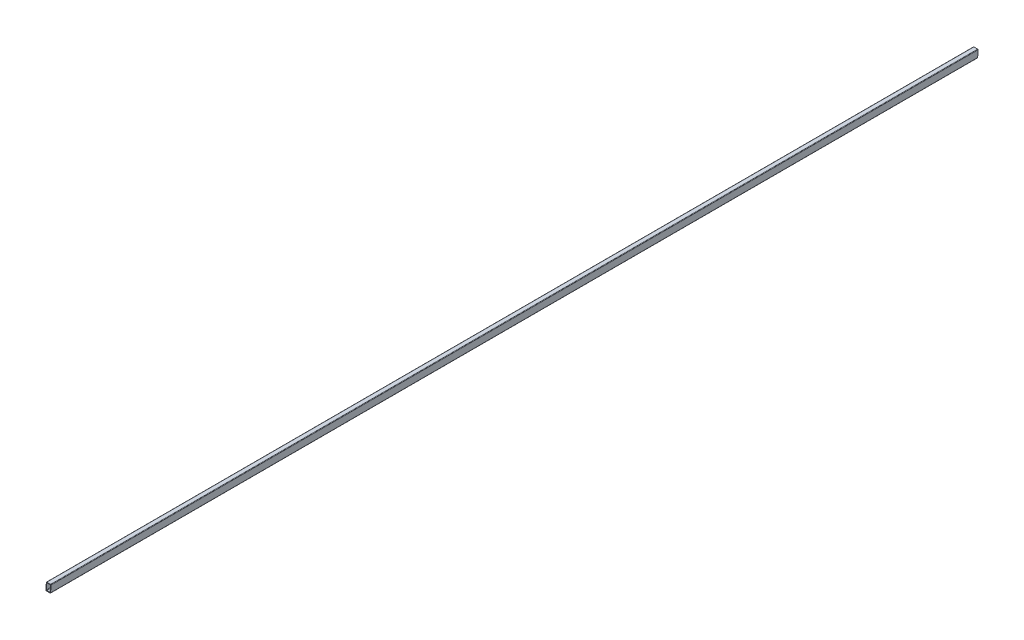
ISO-10303-21;
HEADER;
FILE_DESCRIPTION(('STEP AP214'),'2;1');
FILE_NAME('part.step','',(''),(''),'','','');
FILE_SCHEMA(('AUTOMOTIVE_DESIGN { 1 0 10303 214 1 1 1 1 }'));
ENDSEC;
DATA;
#1=APPLICATION_CONTEXT('core data for automotive mechanical design processes');
#2=APPLICATION_PROTOCOL_DEFINITION('international standard','automotive_design',2000,#1);
#3=PRODUCT_CONTEXT('',#1,'mechanical');
#4=PRODUCT('Part','Part','',(#3));
#5=PRODUCT_RELATED_PRODUCT_CATEGORY('part','',(#4));
#6=PRODUCT_DEFINITION_FORMATION('','',#4);
#7=PRODUCT_DEFINITION_CONTEXT('part definition',#1,'design');
#8=PRODUCT_DEFINITION('design','',#6,#7);
#9=PRODUCT_DEFINITION_SHAPE('','',#8);
#10=(LENGTH_UNIT() NAMED_UNIT(*) SI_UNIT(.MILLI.,.METRE.));
#11=(NAMED_UNIT(*) PLANE_ANGLE_UNIT() SI_UNIT($,.RADIAN.));
#12=(NAMED_UNIT(*) SI_UNIT($,.STERADIAN.) SOLID_ANGLE_UNIT());
#13=UNCERTAINTY_MEASURE_WITH_UNIT(LENGTH_MEASURE(1.E-05),#10,'distance_accuracy_value','');
#14=(GEOMETRIC_REPRESENTATION_CONTEXT(3) GLOBAL_UNCERTAINTY_ASSIGNED_CONTEXT((#13)) GLOBAL_UNIT_ASSIGNED_CONTEXT((#10,
#11,#12)) REPRESENTATION_CONTEXT('',''));
#15=CARTESIAN_POINT('',(0.,0.,0.));
#16=DIRECTION('',(0.,0.,1.));
#17=DIRECTION('',(1.,0.,0.));
#18=AXIS2_PLACEMENT_3D('',#15,#16,#17);
#19=CARTESIAN_POINT('',(-25.,40.,10200.));
#20=DIRECTION('',(1.,0.,0.));
#21=DIRECTION('',(0.,1.,0.));
#22=AXIS2_PLACEMENT_3D('',#19,#20,#21);
#23=PLANE('',#22);
#24=DIRECTION('',(0.,0.,-1.));
#25=VECTOR('',#24,1.);
#26=CARTESIAN_POINT('',(-25.,-35.,10200.));
#27=LINE('',#26,#25);
#28=CARTESIAN_POINT('',(-25.,-35.,3.74999314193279));
#29=VERTEX_POINT('',#28);
#30=CARTESIAN_POINT('',(-25.,-35.,10016.2399931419));
#31=VERTEX_POINT('',#30);
#32=EDGE_CURVE('E189',#29,#31,#27,.F.);
#33=ORIENTED_EDGE('',*,*,#32,.T.);
#34=DIRECTION('',(0.,0.998752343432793,-0.049937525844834));
#35=VECTOR('',#34,1.);
#36=CARTESIAN_POINT('',(-25.,40.,10012.49));
#37=LINE('',#36,#35);
#38=CARTESIAN_POINT('',(-25.,35.,10012.7399995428));
#39=VERTEX_POINT('',#38);
#40=EDGE_CURVE('E166',#31,#39,#37,.T.);
#41=ORIENTED_EDGE('',*,*,#40,.T.);
#42=DIRECTION('',(0.,0.,-1.));
#43=VECTOR('',#42,1.);
#44=CARTESIAN_POINT('',(-25.,35.,10200.));
#45=LINE('',#44,#43);
#46=CARTESIAN_POINT('',(-25.,35.,0.249999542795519));
#47=VERTEX_POINT('',#46);
#48=EDGE_CURVE('E187',#39,#47,#45,.T.);
#49=ORIENTED_EDGE('',*,*,#48,.T.);
#50=DIRECTION('',(0.,-0.998752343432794,0.0499375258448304));
#51=VECTOR('',#50,1.);
#52=CARTESIAN_POINT('',(-25.,40.,0.));
#53=LINE('',#52,#51);
#54=EDGE_CURVE('E223',#47,#29,#53,.T.);
#55=ORIENTED_EDGE('',*,*,#54,.T.);
#56=EDGE_LOOP('',(#33,#41,#49,#55));
#57=FACE_BOUND('',#56,.T.);
#58=ADVANCED_FACE('F38',(#57),#23,.F.);
#59=CARTESIAN_POINT('',(-25.,-40.,10200.));
#60=DIRECTION('',(0.,1.,0.));
#61=DIRECTION('',(0.,0.,1.));
#62=AXIS2_PLACEMENT_3D('',#59,#60,#61);
#63=PLANE('',#62);
#64=DIRECTION('',(0.,0.,-1.));
#65=VECTOR('',#64,1.);
#66=CARTESIAN_POINT('',(20.,-40.,10200.));
#67=LINE('',#66,#65);
#68=CARTESIAN_POINT('',(20.,-40.,3.99999268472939));
#69=VERTEX_POINT('',#68);
#70=CARTESIAN_POINT('',(20.,-40.,10016.4899926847));
#71=VERTEX_POINT('',#70);
#72=EDGE_CURVE('E185',#69,#71,#67,.F.);
#73=ORIENTED_EDGE('',*,*,#72,.T.);
#74=DIRECTION('',(-1.,0.,0.));
#75=VECTOR('',#74,1.);
#76=CARTESIAN_POINT('',(-25.,-40.,10016.4899926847));
#77=LINE('',#76,#75);
#78=CARTESIAN_POINT('',(-20.,-40.,10016.4899926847));
#79=VERTEX_POINT('',#78);
#80=EDGE_CURVE('E151',#71,#79,#77,.T.);
#81=ORIENTED_EDGE('',*,*,#80,.T.);
#82=DIRECTION('',(0.,0.,-1.));
#83=VECTOR('',#82,1.);
#84=CARTESIAN_POINT('',(-20.,-40.,10200.));
#85=LINE('',#84,#83);
#86=CARTESIAN_POINT('',(-20.,-40.,3.99999268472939));
#87=VERTEX_POINT('',#86);
#88=EDGE_CURVE('E183',#79,#87,#85,.T.);
#89=ORIENTED_EDGE('',*,*,#88,.T.);
#90=DIRECTION('',(1.,0.,0.));
#91=VECTOR('',#90,1.);
#92=CARTESIAN_POINT('',(-24.9999999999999,-40.,3.99999268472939));
#93=LINE('',#92,#91);
#94=EDGE_CURVE('E270',#87,#69,#93,.T.);
#95=ORIENTED_EDGE('',*,*,#94,.T.);
#96=EDGE_LOOP('',(#73,#81,#89,#95));
#97=FACE_BOUND('',#96,.T.);
#98=ADVANCED_FACE('F306',(#97),#63,.F.);
#99=CARTESIAN_POINT('',(25.,40.,10200.));
#100=DIRECTION('',(-1.,0.,0.));
#101=DIRECTION('',(0.,-1.,0.));
#102=AXIS2_PLACEMENT_3D('',#99,#100,#101);
#103=PLANE('',#102);
#104=DIRECTION('',(0.,0.,-1.));
#105=VECTOR('',#104,1.);
#106=CARTESIAN_POINT('',(25.,35.,10200.));
#107=LINE('',#106,#105);
#108=CARTESIAN_POINT('',(25.,35.,0.24999954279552));
#109=VERTEX_POINT('',#108);
#110=CARTESIAN_POINT('',(25.,35.,10012.7399995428));
#111=VERTEX_POINT('',#110);
#112=EDGE_CURVE('E165',#109,#111,#107,.F.);
#113=ORIENTED_EDGE('',*,*,#112,.T.);
#114=DIRECTION('',(0.,0.998752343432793,-0.049937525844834));
#115=VECTOR('',#114,1.);
#116=CARTESIAN_POINT('',(25.,40.,10012.49));
#117=LINE('',#116,#115);
#118=CARTESIAN_POINT('',(25.,-35.,10016.2399931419));
#119=VERTEX_POINT('',#118);
#120=EDGE_CURVE('E60',#119,#111,#117,.T.);
#121=ORIENTED_EDGE('',*,*,#120,.F.);
#122=DIRECTION('',(0.,0.,-1.));
#123=VECTOR('',#122,1.);
#124=CARTESIAN_POINT('',(25.,-35.,10200.));
#125=LINE('',#124,#123);
#126=CARTESIAN_POINT('',(25.,-35.,3.7499931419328));
#127=VERTEX_POINT('',#126);
#128=EDGE_CURVE('E162',#119,#127,#125,.T.);
#129=ORIENTED_EDGE('',*,*,#128,.T.);
#130=DIRECTION('',(0.,-0.998752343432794,0.0499375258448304));
#131=VECTOR('',#130,1.);
#132=CARTESIAN_POINT('',(25.,40.,0.));
#133=LINE('',#132,#131);
#134=EDGE_CURVE('E262',#109,#127,#133,.T.);
#135=ORIENTED_EDGE('',*,*,#134,.F.);
#136=EDGE_LOOP('',(#113,#121,#129,#135));
#137=FACE_BOUND('',#136,.T.);
#138=ADVANCED_FACE('F160',(#137),#103,.F.);
#139=CARTESIAN_POINT('',(-25.,40.,10200.));
#140=DIRECTION('',(0.,-1.,0.));
#141=DIRECTION('',(1.,0.,0.));
#142=AXIS2_PLACEMENT_3D('',#139,#140,#141);
#143=PLANE('',#142);
#144=DIRECTION('',(0.,0.,-1.));
#145=VECTOR('',#144,1.);
#146=CARTESIAN_POINT('',(-20.,40.,10200.));
#147=LINE('',#146,#145);
#148=CARTESIAN_POINT('',(-20.,40.,0.));
#149=VERTEX_POINT('',#148);
#150=CARTESIAN_POINT('',(-20.,40.,10012.49));
#151=VERTEX_POINT('',#150);
#152=EDGE_CURVE('E194',#149,#151,#147,.F.);
#153=ORIENTED_EDGE('',*,*,#152,.T.);
#154=DIRECTION('',(1.,0.,0.));
#155=VECTOR('',#154,1.);
#156=CARTESIAN_POINT('',(-25.,40.,10012.49));
#157=LINE('',#156,#155);
#158=CARTESIAN_POINT('',(20.,40.,10012.49));
#159=VERTEX_POINT('',#158);
#160=EDGE_CURVE('E431',#151,#159,#157,.T.);
#161=ORIENTED_EDGE('',*,*,#160,.T.);
#162=DIRECTION('',(0.,0.,-1.));
#163=VECTOR('',#162,1.);
#164=CARTESIAN_POINT('',(20.,40.,10200.));
#165=LINE('',#164,#163);
#166=CARTESIAN_POINT('',(20.,40.,0.));
#167=VERTEX_POINT('',#166);
#168=EDGE_CURVE('E192',#159,#167,#165,.T.);
#169=ORIENTED_EDGE('',*,*,#168,.T.);
#170=DIRECTION('',(-1.,0.,0.));
#171=VECTOR('',#170,1.);
#172=CARTESIAN_POINT('',(-25.,40.,0.));
#173=LINE('',#172,#171);
#174=EDGE_CURVE('E273',#167,#149,#173,.T.);
#175=ORIENTED_EDGE('',*,*,#174,.T.);
#176=EDGE_LOOP('',(#153,#161,#169,#175));
#177=FACE_BOUND('',#176,.T.);
#178=ADVANCED_FACE('F333',(#177),#143,.F.);
#179=CARTESIAN_POINT('',(-20.,35.,10200.));
#180=DIRECTION('',(1.,0.,0.));
#181=DIRECTION('',(0.,1.,0.));
#182=AXIS2_PLACEMENT_3D('',#179,#180,#181);
#183=PLANE('',#182);
#184=DIRECTION('',(0.,0.998752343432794,-0.0499375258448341));
#185=VECTOR('',#184,1.);
#186=CARTESIAN_POINT('',(-20.,25.6603660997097,10013.2069803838));
#187=LINE('',#186,#185);
#188=CARTESIAN_POINT('',(-20.,-30.,10015.9899935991));
#189=VERTEX_POINT('',#188);
#190=CARTESIAN_POINT('',(-20.,30.0000000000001,10012.9899990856));
#191=VERTEX_POINT('',#190);
#192=EDGE_CURVE('E257',#189,#191,#187,.T.);
#193=ORIENTED_EDGE('',*,*,#192,.F.);
#194=DIRECTION('',(0.,0.,-1.));
#195=VECTOR('',#194,1.);
#196=CARTESIAN_POINT('',(-20.,-30.,3.74999314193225));
#197=LINE('',#196,#195);
#198=CARTESIAN_POINT('',(-20.,-30.,3.49999359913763));
#199=VERTEX_POINT('',#198);
#200=EDGE_CURVE('E280',#189,#199,#197,.T.);
#201=ORIENTED_EDGE('',*,*,#200,.T.);
#202=DIRECTION('',(0.,-0.998752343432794,0.0499375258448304));
#203=VECTOR('',#202,1.);
#204=CARTESIAN_POINT('',(-20.,-473.714785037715,25.6856922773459));
#205=LINE('',#204,#203);
#206=CARTESIAN_POINT('',(-20.,30.0000000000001,0.499999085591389));
#207=VERTEX_POINT('',#206);
#208=EDGE_CURVE('E267',#207,#199,#205,.T.);
#209=ORIENTED_EDGE('',*,*,#208,.F.);
#210=DIRECTION('',(0.,0.,-1.));
#211=VECTOR('',#210,1.);
#212=CARTESIAN_POINT('',(-20.,30.,10200.));
#213=LINE('',#212,#211);
#214=EDGE_CURVE('E277',#207,#191,#213,.F.);
#215=ORIENTED_EDGE('',*,*,#214,.T.);
#216=EDGE_LOOP('',(#193,#201,#209,#215));
#217=FACE_BOUND('',#216,.T.);
#218=ADVANCED_FACE('F292',(#217),#183,.T.);
#219=CARTESIAN_POINT('',(-20.,-35.,10200.));
#220=DIRECTION('',(0.,1.,0.));
#221=DIRECTION('',(0.,0.,1.));
#222=AXIS2_PLACEMENT_3D('',#219,#220,#221);
#223=PLANE('',#222);
#224=DIRECTION('',(-1.,0.,0.));
#225=VECTOR('',#224,1.);
#226=CARTESIAN_POINT('',(-20.,-35.,10016.2399931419));
#227=LINE('',#226,#225);
#228=CARTESIAN_POINT('',(15.,-35.,10016.2399931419));
#229=VERTEX_POINT('',#228);
#230=CARTESIAN_POINT('',(-15.,-35.,10016.2399931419));
#231=VERTEX_POINT('',#230);
#232=EDGE_CURVE('E249',#229,#231,#227,.T.);
#233=ORIENTED_EDGE('',*,*,#232,.F.);
#234=DIRECTION('',(0.,0.,-1.));
#235=VECTOR('',#234,1.);
#236=CARTESIAN_POINT('',(15.,-35.,3.74999314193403));
#237=LINE('',#236,#235);
#238=CARTESIAN_POINT('',(15.,-35.,3.74999314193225));
#239=VERTEX_POINT('',#238);
#240=EDGE_CURVE('E231',#229,#239,#237,.T.);
#241=ORIENTED_EDGE('',*,*,#240,.T.);
#242=DIRECTION('',(1.,0.,0.));
#243=VECTOR('',#242,1.);
#244=CARTESIAN_POINT('',(-19.9999999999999,-35.,3.74999314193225));
#245=LINE('',#244,#243);
#246=CARTESIAN_POINT('',(-15.,-35.,3.74999314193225));
#247=VERTEX_POINT('',#246);
#248=EDGE_CURVE('E212',#247,#239,#245,.T.);
#249=ORIENTED_EDGE('',*,*,#248,.F.);
#250=DIRECTION('',(0.,0.,-1.));
#251=VECTOR('',#250,1.);
#252=CARTESIAN_POINT('',(-15.,-35.,10200.));
#253=LINE('',#252,#251);
#254=EDGE_CURVE('E226',#247,#231,#253,.F.);
#255=ORIENTED_EDGE('',*,*,#254,.T.);
#256=EDGE_LOOP('',(#233,#241,#249,#255));
#257=FACE_BOUND('',#256,.T.);
#258=ADVANCED_FACE('F283',(#257),#223,.T.);
#259=CARTESIAN_POINT('',(20.,35.,10200.));
#260=DIRECTION('',(-1.,0.,0.));
#261=DIRECTION('',(0.,-1.,0.));
#262=AXIS2_PLACEMENT_3D('',#259,#260,#261);
#263=PLANE('',#262);
#264=DIRECTION('',(0.,-0.998752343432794,0.0499375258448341));
#265=VECTOR('',#264,1.);
#266=CARTESIAN_POINT('',(20.,25.6603660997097,10013.2069803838));
#267=LINE('',#266,#265);
#268=CARTESIAN_POINT('',(20.,30.0000000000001,10012.9899990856));
#269=VERTEX_POINT('',#268);
#270=CARTESIAN_POINT('',(20.,-30.,10015.9899935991));
#271=VERTEX_POINT('',#270);
#272=EDGE_CURVE('E53',#269,#271,#267,.T.);
#273=ORIENTED_EDGE('',*,*,#272,.F.);
#274=DIRECTION('',(0.,0.,-1.));
#275=VECTOR('',#274,1.);
#276=CARTESIAN_POINT('',(20.,30.,0.249999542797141));
#277=LINE('',#276,#275);
#278=CARTESIAN_POINT('',(20.,30.0000000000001,0.499999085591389));
#279=VERTEX_POINT('',#278);
#280=EDGE_CURVE('E221',#269,#279,#277,.T.);
#281=ORIENTED_EDGE('',*,*,#280,.T.);
#282=DIRECTION('',(0.,0.998752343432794,-0.0499375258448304));
#283=VECTOR('',#282,1.);
#284=CARTESIAN_POINT('',(20.0000000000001,-473.714785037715,25.6856922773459));
#285=LINE('',#284,#283);
#286=CARTESIAN_POINT('',(20.,-30.,3.49999359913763));
#287=VERTEX_POINT('',#286);
#288=EDGE_CURVE('E210',#287,#279,#285,.T.);
#289=ORIENTED_EDGE('',*,*,#288,.F.);
#290=DIRECTION('',(0.,0.,-1.));
#291=VECTOR('',#290,1.);
#292=CARTESIAN_POINT('',(20.,-30.,10200.));
#293=LINE('',#292,#291);
#294=EDGE_CURVE('E219',#287,#271,#293,.F.);
#295=ORIENTED_EDGE('',*,*,#294,.T.);
#296=EDGE_LOOP('',(#273,#281,#289,#295));
#297=FACE_BOUND('',#296,.T.);
#298=ADVANCED_FACE('F218',(#297),#263,.T.);
#299=CARTESIAN_POINT('',(-20.,35.,10200.));
#300=DIRECTION('',(0.,-1.,0.));
#301=DIRECTION('',(0.,0.,-1.));
#302=AXIS2_PLACEMENT_3D('',#299,#300,#301);
#303=PLANE('',#302);
#304=DIRECTION('',(1.,0.,0.));
#305=VECTOR('',#304,1.);
#306=CARTESIAN_POINT('',(-20.,35.,10012.7399995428));
#307=LINE('',#306,#305);
#308=CARTESIAN_POINT('',(-15.,35.,10012.7399995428));
#309=VERTEX_POINT('',#308);
#310=CARTESIAN_POINT('',(15.,35.,10012.7399995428));
#311=VERTEX_POINT('',#310);
#312=EDGE_CURVE('E241',#309,#311,#307,.T.);
#313=ORIENTED_EDGE('',*,*,#312,.F.);
#314=DIRECTION('',(0.,0.,-1.));
#315=VECTOR('',#314,1.);
#316=CARTESIAN_POINT('',(-15.,35.,0.249999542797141));
#317=LINE('',#316,#315);
#318=CARTESIAN_POINT('',(-15.,35.,0.249999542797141));
#319=VERTEX_POINT('',#318);
#320=EDGE_CURVE('E228',#309,#319,#317,.T.);
#321=ORIENTED_EDGE('',*,*,#320,.T.);
#322=DIRECTION('',(-1.,0.,0.));
#323=VECTOR('',#322,1.);
#324=CARTESIAN_POINT('',(-19.9999999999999,35.,0.249999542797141));
#325=LINE('',#324,#323);
#326=CARTESIAN_POINT('',(15.,35.,0.249999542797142));
#327=VERTEX_POINT('',#326);
#328=EDGE_CURVE('E243',#327,#319,#325,.T.);
#329=ORIENTED_EDGE('',*,*,#328,.F.);
#330=DIRECTION('',(0.,0.,-1.));
#331=VECTOR('',#330,1.);
#332=CARTESIAN_POINT('',(15.,35.,10200.));
#333=LINE('',#332,#331);
#334=EDGE_CURVE('E175',#327,#311,#333,.F.);
#335=ORIENTED_EDGE('',*,*,#334,.T.);
#336=EDGE_LOOP('',(#313,#321,#329,#335));
#337=FACE_BOUND('',#336,.T.);
#338=ADVANCED_FACE('F240',(#337),#303,.T.);
#339=CARTESIAN_POINT('',(-25.,40.,0.));
#340=DIRECTION('',(0.,0.0499375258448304,0.998752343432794));
#341=DIRECTION('',(0.,-0.998752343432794,0.0499375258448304));
#342=AXIS2_PLACEMENT_3D('',#339,#340,#341);
#343=PLANE('',#342);
#344=ORIENTED_EDGE('',*,*,#328,.T.);
#345=CARTESIAN_POINT('',(-15.,30.,0.49999908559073));
#346=DIRECTION('',(0.,0.0499375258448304,0.998752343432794));
#347=DIRECTION('',(0.,-0.998752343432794,0.0499375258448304));
#348=AXIS2_PLACEMENT_3D('',#345,#346,#347);
#349=ELLIPSE('',#348,5.00624607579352,5.);
#350=EDGE_CURVE('E201',#319,#207,#349,.T.);
#351=ORIENTED_EDGE('',*,*,#350,.T.);
#352=ORIENTED_EDGE('',*,*,#208,.T.);
#353=CARTESIAN_POINT('',(-15.,-30.,3.49999359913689));
#354=DIRECTION('',(0.,0.0499375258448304,0.998752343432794));
#355=DIRECTION('',(0.,-0.998752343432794,0.0499375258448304));
#356=AXIS2_PLACEMENT_3D('',#353,#354,#355);
#357=ELLIPSE('',#356,5.00624607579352,5.);
#358=EDGE_CURVE('E197',#199,#247,#357,.T.);
#359=ORIENTED_EDGE('',*,*,#358,.T.);
#360=ORIENTED_EDGE('',*,*,#248,.T.);
#361=CARTESIAN_POINT('',(15.,-30.,3.49999359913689));
#362=DIRECTION('',(0.,0.0499375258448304,0.998752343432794));
#363=DIRECTION('',(0.,-0.998752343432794,0.0499375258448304));
#364=AXIS2_PLACEMENT_3D('',#361,#362,#363);
#365=ELLIPSE('',#364,5.00624607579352,5.);
#366=EDGE_CURVE('E46',#239,#287,#365,.T.);
#367=ORIENTED_EDGE('',*,*,#366,.T.);
#368=ORIENTED_EDGE('',*,*,#288,.T.);
#369=CARTESIAN_POINT('',(15.,30.,0.49999908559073));
#370=DIRECTION('',(0.,0.0499375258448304,0.998752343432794));
#371=DIRECTION('',(0.,-0.998752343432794,0.0499375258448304));
#372=AXIS2_PLACEMENT_3D('',#369,#370,#371);
#373=ELLIPSE('',#372,5.00624607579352,5.);
#374=EDGE_CURVE('E199',#279,#327,#373,.T.);
#375=ORIENTED_EDGE('',*,*,#374,.T.);
#376=EDGE_LOOP('',(#344,#351,#352,#359,#360,#367,#368,#375));
#377=FACE_BOUND('',#376,.T.);
#378=ORIENTED_EDGE('',*,*,#134,.T.);
#379=CARTESIAN_POINT('',(20.,-35.,3.74999314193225));
#380=DIRECTION('',(0.,0.0499375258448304,0.998752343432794));
#381=DIRECTION('',(0.,0.998752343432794,-0.0499375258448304));
#382=AXIS2_PLACEMENT_3D('',#379,#380,#381);
#383=ELLIPSE('',#382,5.00624607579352,5.);
#384=EDGE_CURVE('E169',#127,#69,#383,.F.);
#385=ORIENTED_EDGE('',*,*,#384,.T.);
#386=ORIENTED_EDGE('',*,*,#94,.F.);
#387=CARTESIAN_POINT('',(-20.,-35.,3.74999314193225));
#388=DIRECTION('',(0.,0.0499375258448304,0.998752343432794));
#389=DIRECTION('',(0.,0.998752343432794,-0.0499375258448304));
#390=AXIS2_PLACEMENT_3D('',#387,#388,#389);
#391=ELLIPSE('',#390,5.00624607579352,5.);
#392=EDGE_CURVE('E180',#87,#29,#391,.F.);
#393=ORIENTED_EDGE('',*,*,#392,.T.);
#394=ORIENTED_EDGE('',*,*,#54,.F.);
#395=CARTESIAN_POINT('',(-20.,35.,0.249999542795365));
#396=DIRECTION('',(0.,0.0499375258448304,0.998752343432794));
#397=DIRECTION('',(0.,0.998752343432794,-0.0499375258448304));
#398=AXIS2_PLACEMENT_3D('',#395,#396,#397);
#399=ELLIPSE('',#398,5.00624607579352,5.);
#400=EDGE_CURVE('E173',#47,#149,#399,.F.);
#401=ORIENTED_EDGE('',*,*,#400,.T.);
#402=ORIENTED_EDGE('',*,*,#174,.F.);
#403=CARTESIAN_POINT('',(20.,35.,0.249999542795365));
#404=DIRECTION('',(0.,0.0499375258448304,0.998752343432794));
#405=DIRECTION('',(0.,0.998752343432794,-0.0499375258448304));
#406=AXIS2_PLACEMENT_3D('',#403,#404,#405);
#407=ELLIPSE('',#406,5.00624607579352,5.);
#408=EDGE_CURVE('E171',#167,#109,#407,.F.);
#409=ORIENTED_EDGE('',*,*,#408,.T.);
#410=EDGE_LOOP('',(#378,#385,#386,#393,#394,#401,#402,#409));
#411=FACE_BOUND('',#410,.T.);
#412=ADVANCED_FACE('F208',(#377,#411),#343,.F.);
#413=CARTESIAN_POINT('',(-15.,-30.,10200.));
#414=DIRECTION('',(0.,0.,1.));
#415=DIRECTION('',(1.,0.,0.));
#416=AXIS2_PLACEMENT_3D('',#413,#414,#415);
#417=CYLINDRICAL_SURFACE('',#416,5.);
#418=ORIENTED_EDGE('',*,*,#200,.F.);
#419=CARTESIAN_POINT('',(-15.,-30.,10015.9899935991));
#420=DIRECTION('',(0.,-0.049937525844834,-0.998752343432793));
#421=DIRECTION('',(0.,-0.998752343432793,0.0499375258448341));
#422=AXIS2_PLACEMENT_3D('',#419,#420,#421);
#423=ELLIPSE('',#422,5.00624607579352,5.);
#424=EDGE_CURVE('E248',#189,#231,#423,.F.);
#425=ORIENTED_EDGE('',*,*,#424,.T.);
#426=ORIENTED_EDGE('',*,*,#254,.F.);
#427=ORIENTED_EDGE('',*,*,#358,.F.);
#428=EDGE_LOOP('',(#418,#425,#426,#427));
#429=FACE_BOUND('',#428,.T.);
#430=ADVANCED_FACE('F288',(#429),#417,.F.);
#431=CARTESIAN_POINT('',(15.,30.,10200.));
#432=DIRECTION('',(0.,0.,1.));
#433=DIRECTION('',(1.,0.,0.));
#434=AXIS2_PLACEMENT_3D('',#431,#432,#433);
#435=CYLINDRICAL_SURFACE('',#434,5.);
#436=ORIENTED_EDGE('',*,*,#280,.F.);
#437=CARTESIAN_POINT('',(15.,30.,10012.9899990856));
#438=DIRECTION('',(0.,-0.049937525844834,-0.998752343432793));
#439=DIRECTION('',(0.,-0.998752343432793,0.0499375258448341));
#440=AXIS2_PLACEMENT_3D('',#437,#438,#439);
#441=ELLIPSE('',#440,5.00624607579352,5.);
#442=EDGE_CURVE('E247',#269,#311,#441,.F.);
#443=ORIENTED_EDGE('',*,*,#442,.T.);
#444=ORIENTED_EDGE('',*,*,#334,.F.);
#445=ORIENTED_EDGE('',*,*,#374,.F.);
#446=EDGE_LOOP('',(#436,#443,#444,#445));
#447=FACE_BOUND('',#446,.T.);
#448=ADVANCED_FACE('F246',(#447),#435,.F.);
#449=CARTESIAN_POINT('',(-15.,30.,10200.));
#450=DIRECTION('',(0.,0.,1.));
#451=DIRECTION('',(1.,0.,0.));
#452=AXIS2_PLACEMENT_3D('',#449,#450,#451);
#453=CYLINDRICAL_SURFACE('',#452,5.);
#454=ORIENTED_EDGE('',*,*,#320,.F.);
#455=CARTESIAN_POINT('',(-15.,30.,10012.9899990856));
#456=DIRECTION('',(0.,-0.049937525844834,-0.998752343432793));
#457=DIRECTION('',(0.,-0.998752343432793,0.0499375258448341));
#458=AXIS2_PLACEMENT_3D('',#455,#456,#457);
#459=ELLIPSE('',#458,5.00624607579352,5.);
#460=EDGE_CURVE('E259',#309,#191,#459,.F.);
#461=ORIENTED_EDGE('',*,*,#460,.T.);
#462=ORIENTED_EDGE('',*,*,#214,.F.);
#463=ORIENTED_EDGE('',*,*,#350,.F.);
#464=EDGE_LOOP('',(#454,#461,#462,#463));
#465=FACE_BOUND('',#464,.T.);
#466=ADVANCED_FACE('F295',(#465),#453,.F.);
#467=CARTESIAN_POINT('',(15.,-30.,10200.));
#468=DIRECTION('',(0.,0.,1.));
#469=DIRECTION('',(1.,0.,0.));
#470=AXIS2_PLACEMENT_3D('',#467,#468,#469);
#471=CYLINDRICAL_SURFACE('',#470,5.);
#472=ORIENTED_EDGE('',*,*,#240,.F.);
#473=CARTESIAN_POINT('',(15.,-30.,10015.9899935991));
#474=DIRECTION('',(0.,-0.049937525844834,-0.998752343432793));
#475=DIRECTION('',(0.,-0.998752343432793,0.0499375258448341));
#476=AXIS2_PLACEMENT_3D('',#473,#474,#475);
#477=ELLIPSE('',#476,5.00624607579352,5.);
#478=EDGE_CURVE('E156',#229,#271,#477,.F.);
#479=ORIENTED_EDGE('',*,*,#478,.T.);
#480=ORIENTED_EDGE('',*,*,#294,.F.);
#481=ORIENTED_EDGE('',*,*,#366,.F.);
#482=EDGE_LOOP('',(#472,#479,#480,#481));
#483=FACE_BOUND('',#482,.T.);
#484=ADVANCED_FACE('F225',(#483),#471,.F.);
#485=CARTESIAN_POINT('',(20.,-35.,10200.));
#486=DIRECTION('',(0.,0.,-1.));
#487=DIRECTION('',(-1.,0.,0.));
#488=AXIS2_PLACEMENT_3D('',#485,#486,#487);
#489=CYLINDRICAL_SURFACE('',#488,5.);
#490=CARTESIAN_POINT('',(20.,-35.,10016.2399931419));
#491=DIRECTION('',(0.,-0.049937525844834,-0.998752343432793));
#492=DIRECTION('',(0.,0.998752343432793,-0.0499375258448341));
#493=AXIS2_PLACEMENT_3D('',#490,#491,#492);
#494=ELLIPSE('',#493,5.00624607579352,5.);
#495=EDGE_CURVE('E148',#71,#119,#494,.F.);
#496=ORIENTED_EDGE('',*,*,#495,.F.);
#497=ORIENTED_EDGE('',*,*,#72,.F.);
#498=ORIENTED_EDGE('',*,*,#384,.F.);
#499=ORIENTED_EDGE('',*,*,#128,.F.);
#500=EDGE_LOOP('',(#496,#497,#498,#499));
#501=FACE_BOUND('',#500,.T.);
#502=ADVANCED_FACE('F168',(#501),#489,.T.);
#503=CARTESIAN_POINT('',(-20.,-35.,10200.));
#504=DIRECTION('',(0.,0.,-1.));
#505=DIRECTION('',(-1.,0.,0.));
#506=AXIS2_PLACEMENT_3D('',#503,#504,#505);
#507=CYLINDRICAL_SURFACE('',#506,5.);
#508=CARTESIAN_POINT('',(-20.,-35.,10016.2399931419));
#509=DIRECTION('',(0.,-0.049937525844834,-0.998752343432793));
#510=DIRECTION('',(0.,0.998752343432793,-0.0499375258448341));
#511=AXIS2_PLACEMENT_3D('',#508,#509,#510);
#512=ELLIPSE('',#511,5.00624607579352,5.);
#513=EDGE_CURVE('E436',#31,#79,#512,.F.);
#514=ORIENTED_EDGE('',*,*,#513,.F.);
#515=ORIENTED_EDGE('',*,*,#32,.F.);
#516=ORIENTED_EDGE('',*,*,#392,.F.);
#517=ORIENTED_EDGE('',*,*,#88,.F.);
#518=EDGE_LOOP('',(#514,#515,#516,#517));
#519=FACE_BOUND('',#518,.T.);
#520=ADVANCED_FACE('F391',(#519),#507,.T.);
#521=CARTESIAN_POINT('',(-20.,35.,10200.));
#522=DIRECTION('',(0.,0.,-1.));
#523=DIRECTION('',(-1.,0.,0.));
#524=AXIS2_PLACEMENT_3D('',#521,#522,#523);
#525=CYLINDRICAL_SURFACE('',#524,5.);
#526=CARTESIAN_POINT('',(-20.,35.,10012.7399995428));
#527=DIRECTION('',(0.,-0.049937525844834,-0.998752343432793));
#528=DIRECTION('',(0.,0.998752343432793,-0.0499375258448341));
#529=AXIS2_PLACEMENT_3D('',#526,#527,#528);
#530=ELLIPSE('',#529,5.00624607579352,5.);
#531=EDGE_CURVE('E434',#151,#39,#530,.F.);
#532=ORIENTED_EDGE('',*,*,#531,.F.);
#533=ORIENTED_EDGE('',*,*,#152,.F.);
#534=ORIENTED_EDGE('',*,*,#400,.F.);
#535=ORIENTED_EDGE('',*,*,#48,.F.);
#536=EDGE_LOOP('',(#532,#533,#534,#535));
#537=FACE_BOUND('',#536,.T.);
#538=ADVANCED_FACE('F400',(#537),#525,.T.);
#539=CARTESIAN_POINT('',(20.,35.,10200.));
#540=DIRECTION('',(0.,0.,-1.));
#541=DIRECTION('',(-1.,0.,0.));
#542=AXIS2_PLACEMENT_3D('',#539,#540,#541);
#543=CYLINDRICAL_SURFACE('',#542,5.);
#544=CARTESIAN_POINT('',(20.,35.,10012.7399995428));
#545=DIRECTION('',(0.,-0.049937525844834,-0.998752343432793));
#546=DIRECTION('',(0.,0.998752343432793,-0.0499375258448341));
#547=AXIS2_PLACEMENT_3D('',#544,#545,#546);
#548=ELLIPSE('',#547,5.00624607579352,5.);
#549=EDGE_CURVE('E11',#111,#159,#548,.F.);
#550=ORIENTED_EDGE('',*,*,#549,.F.);
#551=ORIENTED_EDGE('',*,*,#112,.F.);
#552=ORIENTED_EDGE('',*,*,#408,.F.);
#553=ORIENTED_EDGE('',*,*,#168,.F.);
#554=EDGE_LOOP('',(#550,#551,#552,#553));
#555=FACE_BOUND('',#554,.T.);
#556=ADVANCED_FACE('F40',(#555),#543,.T.);
#557=CARTESIAN_POINT('',(-25.,40.,10012.49));
#558=DIRECTION('',(0.,-0.049937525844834,-0.998752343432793));
#559=DIRECTION('',(0.,0.998752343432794,-0.0499375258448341));
#560=AXIS2_PLACEMENT_3D('',#557,#558,#559);
#561=PLANE('',#560);
#562=ORIENTED_EDGE('',*,*,#495,.T.);
#563=ORIENTED_EDGE('',*,*,#120,.T.);
#564=ORIENTED_EDGE('',*,*,#549,.T.);
#565=ORIENTED_EDGE('',*,*,#160,.F.);
#566=ORIENTED_EDGE('',*,*,#531,.T.);
#567=ORIENTED_EDGE('',*,*,#40,.F.);
#568=ORIENTED_EDGE('',*,*,#513,.T.);
#569=ORIENTED_EDGE('',*,*,#80,.F.);
#570=EDGE_LOOP('',(#562,#563,#564,#565,#566,#567,#568,#569));
#571=FACE_BOUND('',#570,.T.);
#572=ORIENTED_EDGE('',*,*,#312,.T.);
#573=ORIENTED_EDGE('',*,*,#442,.F.);
#574=ORIENTED_EDGE('',*,*,#272,.T.);
#575=ORIENTED_EDGE('',*,*,#478,.F.);
#576=ORIENTED_EDGE('',*,*,#232,.T.);
#577=ORIENTED_EDGE('',*,*,#424,.F.);
#578=ORIENTED_EDGE('',*,*,#192,.T.);
#579=ORIENTED_EDGE('',*,*,#460,.F.);
#580=EDGE_LOOP('',(#572,#573,#574,#575,#576,#577,#578,#579));
#581=FACE_BOUND('',#580,.T.);
#582=ADVANCED_FACE('F149',(#571,#581),#561,.F.);
#583=CLOSED_SHELL('',(#58,#98,#138,#178,#218,#258,#298,#338,#412,#430,#448,#466,#484,#502,#520,
#538,#556,#582));
#584=MANIFOLD_SOLID_BREP('B2',#583);
#585=ADVANCED_BREP_SHAPE_REPRESENTATION('',(#18,#584),#14);
#586=SHAPE_DEFINITION_REPRESENTATION(#9,#585);
ENDSEC;
END-ISO-10303-21;
